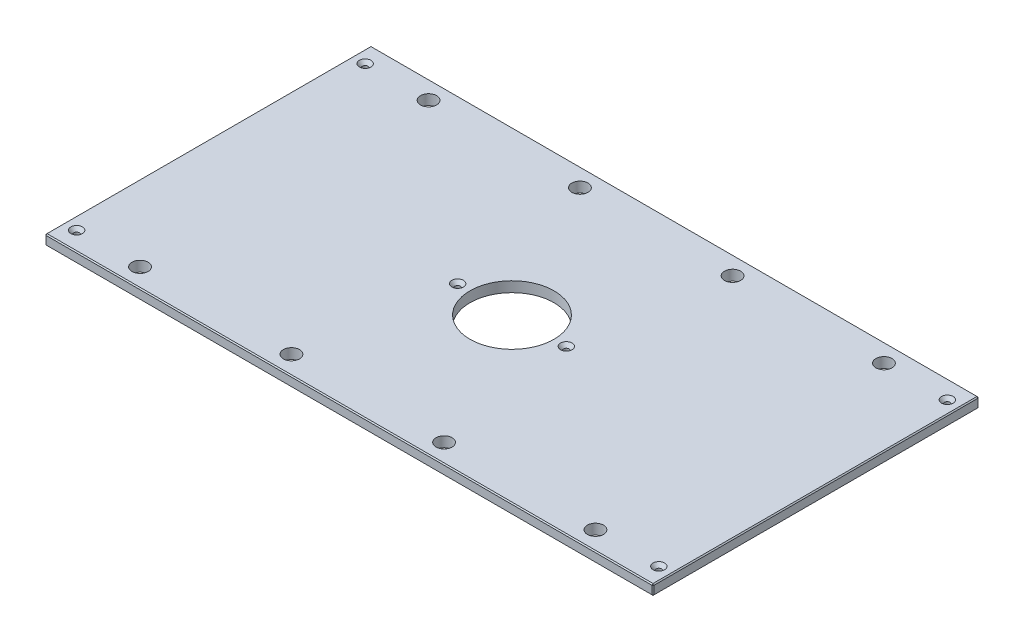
from build123d import *

# Parameters (mm, degrees)
SKETCH1_W                                        = 746.125
SKETCH1_H                                        = 400.05
BOSS_EXTRUDE1_DEPTH                              = 12.7
SKETCH13_R                                       = 51.562
CUT_EXTRUDE6_DEPTH                               = 424.493706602
F_25_32_0_78125_DIAMETER_HOLE1_D                 = 19.84375
CHAMFER2_SIZE                                    = 1.27
CSK_FOR_1_4_FLAT_HEAD_MACHINE_SCREW1_D           = 6.7564
CSK_FOR_1_4_FLAT_HEAD_MACHINE_SCREW1_CSINK_D     = 14.2748
CSK_FOR_1_4_FLAT_HEAD_MACHINE_SCREW1_CSINK_ANGLE = 82


with BuildPart() as part:
    # Sketch1 → Boss-Extrude1 (new body)
    with BuildSketch(Plane(origin=(0, 0, 0), x_dir=(1, 0, 0), z_dir=(0, 1, 0))):
        Rectangle(SKETCH1_W, SKETCH1_H)
    extrude(amount=BOSS_EXTRUDE1_DEPTH)

    # Sketch13 → Cut-Extrude6 (cut, through all)
    with BuildSketch(Plane(origin=(0, 12.7, 0), x_dir=(1, 0, 0), z_dir=(0, 1, 0))):
        with Locations(Location((0, 0, 0), (0, 0, 270))):
            Circle(SKETCH13_R)
    extrude(amount=-CUT_EXTRUDE6_DEPTH, mode=Mode.SUBTRACT)

    # 25_32 _0.78125_ Diameter Hole1 (through all)
    with Locations(Plane(origin=(0, 12.7, 0), x_dir=(1, 0, 0), z_dir=(0, 1, 0))):
        with Locations((279.4, 177.00498), (-279.4, 177.00498), (279.4, -177.00498), (-279.4, -177.00498), (-93.6625, 177.00498), (93.6625, 177.00498), (93.6625, -177.00498), (-93.6625, -177.00498)):
            Hole(F_25_32_0_78125_DIAMETER_HOLE1_D / 2)

    # Chamfer2
    chamfer2_edges = [part.edges().sort_by_distance(p)[0] for p in [
        (373.0625, 12.7, 0),
        (0, 12.7, -200.025),
        (-373.0625, 12.7, 0),
        (0, 0, -200.025),
        (373.0625, 0, 0),
        (0, 0, 200.025),
        (-373.0625, 0, 0),
        (0, 12.7, 200.025),
        (-373.0625, 6.35, -200.025),
        (373.0625, 6.35, -200.025),
        (373.0625, 6.35, 200.025),
        (-373.0625, 6.35, 200.025),
    ]]
    chamfer(chamfer2_edges, length=CHAMFER2_SIZE)

    # CSK for 1_4 Flat Head Machine Screw1 (through all)
    with Locations(Plane(origin=(0, 12.7, 0), x_dir=(1, 0, 0), z_dir=(0, 1, 0))):
        with Locations((357.1875, 177.00498), (357.1875, -177.00498), (-357.1875, -177.00498), (-66.675, 0), (66.675, 0), (-357.1875, 177.00498), (-279.4, 177.00498), (-279.4, -177.00498)):
            CounterSinkHole(CSK_FOR_1_4_FLAT_HEAD_MACHINE_SCREW1_D / 2, CSK_FOR_1_4_FLAT_HEAD_MACHINE_SCREW1_CSINK_D / 2, counter_sink_angle=CSK_FOR_1_4_FLAT_HEAD_MACHINE_SCREW1_CSINK_ANGLE)


solid = part.part
